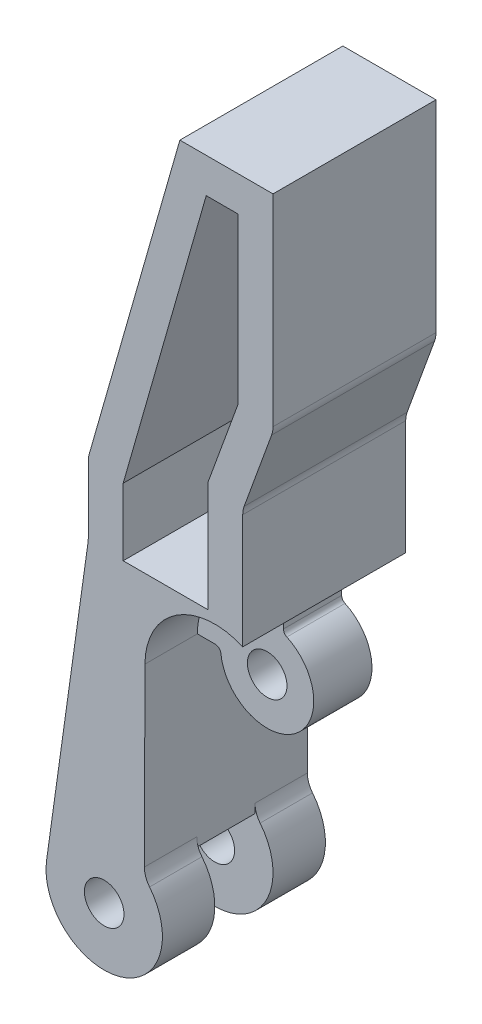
ISO-10303-21;
HEADER;
FILE_DESCRIPTION(('STEP AP214'),'2;1');
FILE_NAME('part.step','',(''),(''),'','','');
FILE_SCHEMA(('AUTOMOTIVE_DESIGN { 1 0 10303 214 1 1 1 1 }'));
ENDSEC;
DATA;
#1=APPLICATION_CONTEXT('core data for automotive mechanical design processes');
#2=APPLICATION_PROTOCOL_DEFINITION('international standard','automotive_design',2000,#1);
#3=PRODUCT_CONTEXT('',#1,'mechanical');
#4=PRODUCT('Part','Part','',(#3));
#5=PRODUCT_RELATED_PRODUCT_CATEGORY('part','',(#4));
#6=PRODUCT_DEFINITION_FORMATION('','',#4);
#7=PRODUCT_DEFINITION_CONTEXT('part definition',#1,'design');
#8=PRODUCT_DEFINITION('design','',#6,#7);
#9=PRODUCT_DEFINITION_SHAPE('','',#8);
#10=(LENGTH_UNIT() NAMED_UNIT(*) SI_UNIT(.MILLI.,.METRE.));
#11=(NAMED_UNIT(*) PLANE_ANGLE_UNIT() SI_UNIT($,.RADIAN.));
#12=(NAMED_UNIT(*) SI_UNIT($,.STERADIAN.) SOLID_ANGLE_UNIT());
#13=UNCERTAINTY_MEASURE_WITH_UNIT(LENGTH_MEASURE(1.E-05),#10,'distance_accuracy_value','');
#14=(GEOMETRIC_REPRESENTATION_CONTEXT(3) GLOBAL_UNCERTAINTY_ASSIGNED_CONTEXT((#13)) GLOBAL_UNIT_ASSIGNED_CONTEXT((#10,
#11,#12)) REPRESENTATION_CONTEXT('',''));
#15=CARTESIAN_POINT('',(0.,0.,0.));
#16=DIRECTION('',(0.,0.,1.));
#17=DIRECTION('',(1.,0.,0.));
#18=AXIS2_PLACEMENT_3D('',#15,#16,#17);
#19=CARTESIAN_POINT('',(0.,0.,-7.));
#20=DIRECTION('',(0.,0.,1.));
#21=DIRECTION('',(1.,0.,0.));
#22=AXIS2_PLACEMENT_3D('',#19,#20,#21);
#23=PLANE('',#22);
#24=DIRECTION('',(0.,-1.,0.));
#25=VECTOR('',#24,1.);
#26=CARTESIAN_POINT('',(-1.36999818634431,0.,-7.));
#27=LINE('',#26,#25);
#28=CARTESIAN_POINT('',(-1.36999818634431,32.1815612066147,-7.));
#29=VERTEX_POINT('',#28);
#30=CARTESIAN_POINT('',(-1.36999818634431,26.4100008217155,-7.));
#31=VERTEX_POINT('',#30);
#32=EDGE_CURVE('E429',#29,#31,#27,.T.);
#33=ORIENTED_EDGE('',*,*,#32,.F.);
#34=CARTESIAN_POINT('',(0.630001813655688,32.1815612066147,-7.));
#35=DIRECTION('',(0.,0.,1.));
#36=DIRECTION('',(1.,0.,0.));
#37=AXIS2_PLACEMENT_3D('',#34,#35,#36);
#38=CIRCLE('',#37,2.);
#39=CARTESIAN_POINT('',(-1.29301060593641,32.7311276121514,-7.));
#40=VERTEX_POINT('',#39);
#41=EDGE_CURVE('E475',#29,#40,#38,.F.);
#42=ORIENTED_EDGE('',*,*,#41,.T.);
#43=DIRECTION('',(-0.274783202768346,-0.961506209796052,0.));
#44=VECTOR('',#43,1.);
#45=CARTESIAN_POINT('',(-9.84313310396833,2.81301109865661,-7.));
#46=LINE('',#45,#44);
#47=CARTESIAN_POINT('',(6.49999999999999,60.,-7.));
#48=VERTEX_POINT('',#47);
#49=EDGE_CURVE('E426',#48,#40,#46,.T.);
#50=ORIENTED_EDGE('',*,*,#49,.F.);
#51=DIRECTION('',(1.,0.,0.));
#52=VECTOR('',#51,1.);
#53=CARTESIAN_POINT('',(0.,60.,-7.));
#54=LINE('',#53,#52);
#55=CARTESIAN_POINT('',(14.5,60.,-7.));
#56=VERTEX_POINT('',#55);
#57=EDGE_CURVE('E423',#48,#56,#54,.T.);
#58=ORIENTED_EDGE('',*,*,#57,.T.);
#59=DIRECTION('',(0.,-1.,0.));
#60=VECTOR('',#59,1.);
#61=CARTESIAN_POINT('',(14.5,0.,-7.));
#62=LINE('',#61,#60);
#63=CARTESIAN_POINT('',(14.5,42.6783400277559,-7.));
#64=VERTEX_POINT('',#63);
#65=EDGE_CURVE('E420',#56,#64,#62,.T.);
#66=ORIENTED_EDGE('',*,*,#65,.T.);
#67=CARTESIAN_POINT('',(12.5,42.6783400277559,-7.));
#68=DIRECTION('',(0.,0.,1.));
#69=DIRECTION('',(1.,0.,0.));
#70=AXIS2_PLACEMENT_3D('',#67,#68,#69);
#71=CIRCLE('',#70,2.);
#72=CARTESIAN_POINT('',(14.3792376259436,41.9938943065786,-7.));
#73=VERTEX_POINT('',#72);
#74=EDGE_CURVE('E473',#64,#73,#71,.F.);
#75=ORIENTED_EDGE('',*,*,#74,.T.);
#76=DIRECTION('',(-0.342222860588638,-0.939618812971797,0.));
#77=VECTOR('',#76,1.);
#78=CARTESIAN_POINT('',(-0.808324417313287,0.294403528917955,-7.));
#79=LINE('',#78,#77);
#80=CARTESIAN_POINT('',(12.0186781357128,35.5126612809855,-7.));
#81=VERTEX_POINT('',#80);
#82=EDGE_CURVE('E417',#73,#81,#79,.T.);
#83=ORIENTED_EDGE('',*,*,#82,.T.);
#84=CARTESIAN_POINT('',(13.8979157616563,34.8282155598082,-7.));
#85=DIRECTION('',(0.,0.,1.));
#86=DIRECTION('',(1.,0.,0.));
#87=AXIS2_PLACEMENT_3D('',#84,#85,#86);
#88=CIRCLE('',#87,2.);
#89=CARTESIAN_POINT('',(11.8979157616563,34.8282155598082,-7.));
#90=VERTEX_POINT('',#89);
#91=EDGE_CURVE('E43',#81,#90,#88,.T.);
#92=ORIENTED_EDGE('',*,*,#91,.T.);
#93=DIRECTION('',(0.,-1.,0.));
#94=VECTOR('',#93,1.);
#95=CARTESIAN_POINT('',(11.8979157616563,0.,-7.));
#96=LINE('',#95,#94);
#97=CARTESIAN_POINT('',(11.8979157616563,25.,-7.));
#98=VERTEX_POINT('',#97);
#99=EDGE_CURVE('E415',#90,#98,#96,.T.);
#100=ORIENTED_EDGE('',*,*,#99,.T.);
#101=CARTESIAN_POINT('',(9.5,19.5,-7.));
#102=DIRECTION('',(0.,0.,1.));
#103=DIRECTION('',(1.,0.,0.));
#104=AXIS2_PLACEMENT_3D('',#101,#102,#103);
#105=CIRCLE('',#104,6.);
#106=CARTESIAN_POINT('',(3.50003077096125,19.5192158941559,-7.));
#107=VERTEX_POINT('',#106);
#108=EDGE_CURVE('E384',#98,#107,#105,.T.);
#109=ORIENTED_EDGE('',*,*,#108,.T.);
#110=DIRECTION('',(0.00320264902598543,0.999994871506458,0.));
#111=VECTOR('',#110,1.);
#112=CARTESIAN_POINT('',(3.43748199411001,-0.0110091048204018,-7.));
#113=LINE('',#112,#111);
#114=CARTESIAN_POINT('',(3.45160040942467,4.39732374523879,-7.));
#115=VERTEX_POINT('',#114);
#116=EDGE_CURVE('E389',#115,#107,#113,.T.);
#117=ORIENTED_EDGE('',*,*,#116,.F.);
#118=CARTESIAN_POINT('',(5.45159015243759,4.39091844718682,-7.));
#119=DIRECTION('',(0.,0.,1.));
#120=DIRECTION('',(1.,0.,0.));
#121=AXIS2_PLACEMENT_3D('',#118,#119,#120);
#122=CIRCLE('',#121,2.);
#123=CARTESIAN_POINT('',(3.89399296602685,3.13637031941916,-7.));
#124=VERTEX_POINT('',#123);
#125=EDGE_CURVE('E492',#115,#124,#122,.T.);
#126=ORIENTED_EDGE('',*,*,#125,.T.);
#127=CARTESIAN_POINT('',(0.,0.,-7.));
#128=DIRECTION('',(0.,0.,1.));
#129=DIRECTION('',(1.,0.,0.));
#130=AXIS2_PLACEMENT_3D('',#127,#128,#129);
#131=CIRCLE('',#130,5.);
#132=CARTESIAN_POINT('',(-4.95168551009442,0.693405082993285,-7.));
#133=VERTEX_POINT('',#132);
#134=EDGE_CURVE('E434',#133,#124,#131,.T.);
#135=ORIENTED_EDGE('',*,*,#134,.F.);
#136=DIRECTION('',(-0.138681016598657,-0.990337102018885,0.));
#137=VECTOR('',#136,1.);
#138=CARTESIAN_POINT('',(-4.95168551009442,0.693405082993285,-7.));
#139=LINE('',#138,#137);
#140=CARTESIAN_POINT('',(-1.38932398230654,26.1326387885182,-7.));
#141=VERTEX_POINT('',#140);
#142=EDGE_CURVE('E432',#141,#133,#139,.T.);
#143=ORIENTED_EDGE('',*,*,#142,.F.);
#144=CARTESIAN_POINT('',(-3.36999818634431,26.4100008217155,-7.));
#145=DIRECTION('',(0.,0.,1.));
#146=DIRECTION('',(1.,0.,0.));
#147=AXIS2_PLACEMENT_3D('',#144,#145,#146);
#148=CIRCLE('',#147,2.);
#149=EDGE_CURVE('E500',#141,#31,#148,.T.);
#150=ORIENTED_EDGE('',*,*,#149,.T.);
#151=EDGE_LOOP('',(#33,#42,#50,#58,#66,#75,#83,#92,#100,#109,#117,#126,#135,#143,#150));
#152=FACE_BOUND('',#151,.T.);
#153=DIRECTION('',(1.,0.,0.));
#154=VECTOR('',#153,1.);
#155=CARTESIAN_POINT('',(1.63000181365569,26.2706465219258,-7.));
#156=LINE('',#155,#154);
#157=CARTESIAN_POINT('',(1.63000181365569,26.2706465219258,-7.));
#158=VERTEX_POINT('',#157);
#159=CARTESIAN_POINT('',(8.89791576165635,26.2706465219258,-7.));
#160=VERTEX_POINT('',#159);
#161=EDGE_CURVE('E342',#158,#160,#156,.T.);
#162=ORIENTED_EDGE('',*,*,#161,.T.);
#163=DIRECTION('',(0.,1.,0.));
#164=VECTOR('',#163,1.);
#165=CARTESIAN_POINT('',(8.89791576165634,35.7104065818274,-7.));
#166=LINE('',#165,#164);
#167=CARTESIAN_POINT('',(8.89791576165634,35.7104065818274,-7.));
#168=VERTEX_POINT('',#167);
#169=EDGE_CURVE('E324',#160,#168,#166,.T.);
#170=ORIENTED_EDGE('',*,*,#169,.T.);
#171=DIRECTION('',(0.342222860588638,0.939618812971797,0.));
#172=VECTOR('',#171,1.);
#173=CARTESIAN_POINT('',(11.5,42.8547782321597,-7.));
#174=LINE('',#173,#172);
#175=CARTESIAN_POINT('',(11.5,42.8547782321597,-7.));
#176=VERTEX_POINT('',#175);
#177=EDGE_CURVE('E327',#168,#176,#174,.T.);
#178=ORIENTED_EDGE('',*,*,#177,.T.);
#179=DIRECTION('',(0.,1.,0.));
#180=VECTOR('',#179,1.);
#181=CARTESIAN_POINT('',(11.5,57.,-7.));
#182=LINE('',#181,#180);
#183=CARTESIAN_POINT('',(11.5,57.,-7.));
#184=VERTEX_POINT('',#183);
#185=EDGE_CURVE('E330',#176,#184,#182,.T.);
#186=ORIENTED_EDGE('',*,*,#185,.T.);
#187=DIRECTION('',(-1.,0.,0.));
#188=VECTOR('',#187,1.);
#189=CARTESIAN_POINT('',(8.76275230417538,57.,-7.));
#190=LINE('',#189,#188);
#191=CARTESIAN_POINT('',(8.76275230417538,57.,-7.));
#192=VERTEX_POINT('',#191);
#193=EDGE_CURVE('E333',#184,#192,#190,.T.);
#194=ORIENTED_EDGE('',*,*,#193,.T.);
#195=DIRECTION('',(-0.274783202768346,-0.961506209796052,0.));
#196=VECTOR('',#195,1.);
#197=CARTESIAN_POINT('',(1.63000181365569,32.0414733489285,-7.));
#198=LINE('',#197,#196);
#199=CARTESIAN_POINT('',(1.63000181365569,32.0414733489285,-7.));
#200=VERTEX_POINT('',#199);
#201=EDGE_CURVE('E336',#192,#200,#198,.T.);
#202=ORIENTED_EDGE('',*,*,#201,.T.);
#203=DIRECTION('',(0.,-1.,0.));
#204=VECTOR('',#203,1.);
#205=CARTESIAN_POINT('',(1.63000181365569,26.2706465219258,-7.));
#206=LINE('',#205,#204);
#207=EDGE_CURVE('E339',#200,#158,#206,.T.);
#208=ORIENTED_EDGE('',*,*,#207,.T.);
#209=EDGE_LOOP('',(#162,#170,#178,#186,#194,#202,#208));
#210=FACE_BOUND('',#209,.T.);
#211=CARTESIAN_POINT('',(0.,0.,-7.));
#212=DIRECTION('',(0.,0.,-1.));
#213=DIRECTION('',(-1.,0.,0.));
#214=AXIS2_PLACEMENT_3D('',#211,#212,#213);
#215=CIRCLE('',#214,3.36);
#216=CARTESIAN_POINT('',(-3.36,0.,-7.));
#217=VERTEX_POINT('',#216);
#218=EDGE_CURVE('E671',#217,#217,#215,.T.);
#219=ORIENTED_EDGE('',*,*,#218,.F.);
#220=EDGE_LOOP('',(#219));
#221=FACE_BOUND('',#220,.T.);
#222=ADVANCED_FACE('F35',(#152,#210,#221),#23,.F.);
#223=CARTESIAN_POINT('',(0.,0.,7.));
#224=DIRECTION('',(0.,0.,-1.));
#225=DIRECTION('',(-1.,0.,0.));
#226=AXIS2_PLACEMENT_3D('',#223,#224,#225);
#227=CYLINDRICAL_SURFACE('',#226,5.);
#228=ORIENTED_EDGE('',*,*,#134,.T.);
#229=DIRECTION('',(0.,0.,-1.));
#230=VECTOR('',#229,1.);
#231=CARTESIAN_POINT('',(3.89399296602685,3.13637031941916,7.));
#232=LINE('',#231,#230);
#233=CARTESIAN_POINT('',(3.89399296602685,3.13637031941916,-2.5));
#234=VERTEX_POINT('',#233);
#235=EDGE_CURVE('E461',#124,#234,#232,.F.);
#236=ORIENTED_EDGE('',*,*,#235,.T.);
#237=CARTESIAN_POINT('',(0.,0.,-2.5));
#238=DIRECTION('',(0.,0.,1.));
#239=DIRECTION('',(1.,0.,0.));
#240=AXIS2_PLACEMENT_3D('',#237,#238,#239);
#241=CIRCLE('',#240,5.);
#242=CARTESIAN_POINT('',(-4.95168551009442,0.693405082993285,-2.5));
#243=VERTEX_POINT('',#242);
#244=EDGE_CURVE('E270',#243,#234,#241,.T.);
#245=ORIENTED_EDGE('',*,*,#244,.F.);
#246=DIRECTION('',(0.,0.,-1.));
#247=VECTOR('',#246,1.);
#248=CARTESIAN_POINT('',(-4.95168551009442,0.693405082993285,7.));
#249=LINE('',#248,#247);
#250=EDGE_CURVE('E264',#243,#133,#249,.T.);
#251=ORIENTED_EDGE('',*,*,#250,.T.);
#252=EDGE_LOOP('',(#228,#236,#245,#251));
#253=FACE_BOUND('',#252,.T.);
#254=ADVANCED_FACE('F565',(#253),#227,.T.);
#255=CARTESIAN_POINT('',(9.5,19.5,7.));
#256=DIRECTION('',(0.,0.,-1.));
#257=DIRECTION('',(-1.,0.,0.));
#258=AXIS2_PLACEMENT_3D('',#255,#256,#257);
#259=CYLINDRICAL_SURFACE('',#258,6.);
#260=CARTESIAN_POINT('',(9.5,19.5,2.5));
#261=DIRECTION('',(0.,0.,1.));
#262=DIRECTION('',(1.,0.,0.));
#263=AXIS2_PLACEMENT_3D('',#260,#261,#262);
#264=CIRCLE('',#263,6.);
#265=CARTESIAN_POINT('',(10.8979157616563,25.3348805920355,2.5));
#266=VERTEX_POINT('',#265);
#267=CARTESIAN_POINT('',(3.50003077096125,19.5192158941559,2.5));
#268=VERTEX_POINT('',#267);
#269=EDGE_CURVE('E280',#266,#268,#264,.T.);
#270=ORIENTED_EDGE('',*,*,#269,.F.);
#271=DIRECTION('',(0.,0.,-1.));
#272=VECTOR('',#271,1.);
#273=CARTESIAN_POINT('',(10.8979157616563,25.3348805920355,2.5));
#274=LINE('',#273,#272);
#275=CARTESIAN_POINT('',(10.8979157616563,25.3348805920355,-2.5));
#276=VERTEX_POINT('',#275);
#277=EDGE_CURVE('E295',#266,#276,#274,.T.);
#278=ORIENTED_EDGE('',*,*,#277,.T.);
#279=CARTESIAN_POINT('',(9.5,19.5,-2.5));
#280=DIRECTION('',(0.,0.,1.));
#281=DIRECTION('',(1.,0.,0.));
#282=AXIS2_PLACEMENT_3D('',#279,#280,#281);
#283=CIRCLE('',#282,6.);
#284=CARTESIAN_POINT('',(3.50003077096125,19.5192158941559,-2.5));
#285=VERTEX_POINT('',#284);
#286=EDGE_CURVE('E279',#276,#285,#283,.T.);
#287=ORIENTED_EDGE('',*,*,#286,.T.);
#288=DIRECTION('',(0.,0.,-1.));
#289=VECTOR('',#288,1.);
#290=CARTESIAN_POINT('',(3.50003077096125,19.5192158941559,7.));
#291=LINE('',#290,#289);
#292=EDGE_CURVE('E412',#285,#107,#291,.T.);
#293=ORIENTED_EDGE('',*,*,#292,.T.);
#294=ORIENTED_EDGE('',*,*,#108,.F.);
#295=DIRECTION('',(0.,0.,-1.));
#296=VECTOR('',#295,1.);
#297=CARTESIAN_POINT('',(11.8979157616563,25.,7.));
#298=LINE('',#297,#296);
#299=CARTESIAN_POINT('',(11.8979157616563,25.,7.));
#300=VERTEX_POINT('',#299);
#301=EDGE_CURVE('E256',#300,#98,#298,.T.);
#302=ORIENTED_EDGE('',*,*,#301,.F.);
#303=CARTESIAN_POINT('',(9.5,19.5,7.));
#304=DIRECTION('',(0.,0.,1.));
#305=DIRECTION('',(1.,0.,0.));
#306=AXIS2_PLACEMENT_3D('',#303,#304,#305);
#307=CIRCLE('',#306,6.);
#308=CARTESIAN_POINT('',(3.50003077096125,19.5192158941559,7.));
#309=VERTEX_POINT('',#308);
#310=EDGE_CURVE('E385',#300,#309,#307,.T.);
#311=ORIENTED_EDGE('',*,*,#310,.T.);
#312=EDGE_CURVE('E265',#309,#268,#291,.T.);
#313=ORIENTED_EDGE('',*,*,#312,.T.);
#314=EDGE_LOOP('',(#270,#278,#287,#293,#294,#302,#311,#313));
#315=FACE_BOUND('',#314,.T.);
#316=ADVANCED_FACE('F573',(#315),#259,.F.);
#317=CARTESIAN_POINT('',(11.8979157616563,0.,7.));
#318=DIRECTION('',(1.,0.,0.));
#319=DIRECTION('',(0.,0.,-1.));
#320=AXIS2_PLACEMENT_3D('',#317,#318,#319);
#321=PLANE('',#320);
#322=ORIENTED_EDGE('',*,*,#99,.F.);
#323=DIRECTION('',(0.,0.,-1.));
#324=VECTOR('',#323,1.);
#325=CARTESIAN_POINT('',(11.8979157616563,34.8282155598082,7.));
#326=LINE('',#325,#324);
#327=CARTESIAN_POINT('',(11.8979157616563,34.8282155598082,7.));
#328=VERTEX_POINT('',#327);
#329=EDGE_CURVE('E490',#90,#328,#326,.F.);
#330=ORIENTED_EDGE('',*,*,#329,.T.);
#331=DIRECTION('',(0.,-1.,0.));
#332=VECTOR('',#331,1.);
#333=CARTESIAN_POINT('',(11.8979157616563,0.,7.));
#334=LINE('',#333,#332);
#335=EDGE_CURVE('E388',#328,#300,#334,.T.);
#336=ORIENTED_EDGE('',*,*,#335,.T.);
#337=ORIENTED_EDGE('',*,*,#301,.T.);
#338=EDGE_LOOP('',(#322,#330,#336,#337));
#339=FACE_BOUND('',#338,.T.);
#340=ADVANCED_FACE('F512',(#339),#321,.T.);
#341=CARTESIAN_POINT('',(-0.808324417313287,0.294403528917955,7.));
#342=DIRECTION('',(0.939618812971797,-0.342222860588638,0.));
#343=DIRECTION('',(0.342222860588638,0.939618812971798,0.));
#344=AXIS2_PLACEMENT_3D('',#341,#342,#343);
#345=PLANE('',#344);
#346=ORIENTED_EDGE('',*,*,#82,.F.);
#347=DIRECTION('',(0.,0.,-1.));
#348=VECTOR('',#347,1.);
#349=CARTESIAN_POINT('',(14.3792376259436,41.9938943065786,7.));
#350=LINE('',#349,#348);
#351=CARTESIAN_POINT('',(14.3792376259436,41.9938943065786,7.));
#352=VERTEX_POINT('',#351);
#353=EDGE_CURVE('E488',#73,#352,#350,.F.);
#354=ORIENTED_EDGE('',*,*,#353,.T.);
#355=DIRECTION('',(-0.342222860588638,-0.939618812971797,0.));
#356=VECTOR('',#355,1.);
#357=CARTESIAN_POINT('',(-0.808324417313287,0.294403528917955,7.));
#358=LINE('',#357,#356);
#359=CARTESIAN_POINT('',(12.0186781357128,35.5126612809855,7.));
#360=VERTEX_POINT('',#359);
#361=EDGE_CURVE('E391',#352,#360,#358,.T.);
#362=ORIENTED_EDGE('',*,*,#361,.T.);
#363=DIRECTION('',(0.,0.,-1.));
#364=VECTOR('',#363,1.);
#365=CARTESIAN_POINT('',(12.0186781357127,35.5126612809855,-7.));
#366=LINE('',#365,#364);
#367=EDGE_CURVE('E485',#360,#81,#366,.T.);
#368=ORIENTED_EDGE('',*,*,#367,.T.);
#369=EDGE_LOOP('',(#346,#354,#362,#368));
#370=FACE_BOUND('',#369,.T.);
#371=ADVANCED_FACE('F520',(#370),#345,.T.);
#372=CARTESIAN_POINT('',(14.5,0.,7.));
#373=DIRECTION('',(1.,0.,0.));
#374=DIRECTION('',(0.,1.,0.));
#375=AXIS2_PLACEMENT_3D('',#372,#373,#374);
#376=PLANE('',#375);
#377=DIRECTION('',(0.,-1.,0.));
#378=VECTOR('',#377,1.);
#379=CARTESIAN_POINT('',(14.5,0.,7.));
#380=LINE('',#379,#378);
#381=CARTESIAN_POINT('',(14.5,60.,7.));
#382=VERTEX_POINT('',#381);
#383=CARTESIAN_POINT('',(14.5,42.6783400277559,7.));
#384=VERTEX_POINT('',#383);
#385=EDGE_CURVE('E394',#382,#384,#380,.T.);
#386=ORIENTED_EDGE('',*,*,#385,.T.);
#387=DIRECTION('',(0.,0.,-1.));
#388=VECTOR('',#387,1.);
#389=CARTESIAN_POINT('',(14.5,42.6783400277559,7.));
#390=LINE('',#389,#388);
#391=EDGE_CURVE('E482',#384,#64,#390,.T.);
#392=ORIENTED_EDGE('',*,*,#391,.T.);
#393=ORIENTED_EDGE('',*,*,#65,.F.);
#394=DIRECTION('',(0.,0.,-1.));
#395=VECTOR('',#394,1.);
#396=CARTESIAN_POINT('',(14.5,60.,7.));
#397=LINE('',#396,#395);
#398=EDGE_CURVE('E445',#382,#56,#397,.T.);
#399=ORIENTED_EDGE('',*,*,#398,.F.);
#400=EDGE_LOOP('',(#386,#392,#393,#399));
#401=FACE_BOUND('',#400,.T.);
#402=ADVANCED_FACE('F527',(#401),#376,.T.);
#403=CARTESIAN_POINT('',(0.,60.,7.));
#404=DIRECTION('',(0.,1.,0.));
#405=DIRECTION('',(-1.,0.,0.));
#406=AXIS2_PLACEMENT_3D('',#403,#404,#405);
#407=PLANE('',#406);
#408=ORIENTED_EDGE('',*,*,#57,.F.);
#409=DIRECTION('',(0.,0.,-1.));
#410=VECTOR('',#409,1.);
#411=CARTESIAN_POINT('',(6.49999999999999,60.,7.));
#412=LINE('',#411,#410);
#413=CARTESIAN_POINT('',(6.49999999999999,60.,7.));
#414=VERTEX_POINT('',#413);
#415=EDGE_CURVE('E443',#414,#48,#412,.T.);
#416=ORIENTED_EDGE('',*,*,#415,.F.);
#417=DIRECTION('',(1.,0.,0.));
#418=VECTOR('',#417,1.);
#419=CARTESIAN_POINT('',(0.,60.,7.));
#420=LINE('',#419,#418);
#421=EDGE_CURVE('E396',#414,#382,#420,.T.);
#422=ORIENTED_EDGE('',*,*,#421,.T.);
#423=ORIENTED_EDGE('',*,*,#398,.T.);
#424=EDGE_LOOP('',(#408,#416,#422,#423));
#425=FACE_BOUND('',#424,.T.);
#426=ADVANCED_FACE('F531',(#425),#407,.T.);
#427=CARTESIAN_POINT('',(-9.84313310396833,2.81301109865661,7.));
#428=DIRECTION('',(0.961506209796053,-0.274783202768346,0.));
#429=DIRECTION('',(0.274783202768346,0.961506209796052,0.));
#430=AXIS2_PLACEMENT_3D('',#427,#428,#429);
#431=PLANE('',#430);
#432=ORIENTED_EDGE('',*,*,#49,.T.);
#433=DIRECTION('',(0.,0.,-1.));
#434=VECTOR('',#433,1.);
#435=CARTESIAN_POINT('',(-1.29301060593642,32.7311276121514,7.));
#436=LINE('',#435,#434);
#437=CARTESIAN_POINT('',(-1.29301060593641,32.7311276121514,7.));
#438=VERTEX_POINT('',#437);
#439=EDGE_CURVE('E477',#40,#438,#436,.F.);
#440=ORIENTED_EDGE('',*,*,#439,.T.);
#441=DIRECTION('',(-0.274783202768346,-0.961506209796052,0.));
#442=VECTOR('',#441,1.);
#443=CARTESIAN_POINT('',(-9.84313310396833,2.81301109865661,7.));
#444=LINE('',#443,#442);
#445=EDGE_CURVE('E399',#414,#438,#444,.T.);
#446=ORIENTED_EDGE('',*,*,#445,.F.);
#447=ORIENTED_EDGE('',*,*,#415,.T.);
#448=EDGE_LOOP('',(#432,#440,#446,#447));
#449=FACE_BOUND('',#448,.T.);
#450=ADVANCED_FACE('F800',(#449),#431,.F.);
#451=CARTESIAN_POINT('',(-1.36999818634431,0.,7.));
#452=DIRECTION('',(1.,0.,0.));
#453=DIRECTION('',(0.,0.,-1.));
#454=AXIS2_PLACEMENT_3D('',#451,#452,#453);
#455=PLANE('',#454);
#456=ORIENTED_EDGE('',*,*,#32,.T.);
#457=DIRECTION('',(0.,0.,-1.));
#458=VECTOR('',#457,1.);
#459=CARTESIAN_POINT('',(-1.36999818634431,26.4100008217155,7.));
#460=LINE('',#459,#458);
#461=CARTESIAN_POINT('',(-1.36999818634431,26.4100008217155,7.));
#462=VERTEX_POINT('',#461);
#463=EDGE_CURVE('E471',#31,#462,#460,.F.);
#464=ORIENTED_EDGE('',*,*,#463,.T.);
#465=DIRECTION('',(0.,-1.,0.));
#466=VECTOR('',#465,1.);
#467=CARTESIAN_POINT('',(-1.36999818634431,0.,7.));
#468=LINE('',#467,#466);
#469=CARTESIAN_POINT('',(-1.36999818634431,32.1815612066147,7.));
#470=VERTEX_POINT('',#469);
#471=EDGE_CURVE('E402',#470,#462,#468,.T.);
#472=ORIENTED_EDGE('',*,*,#471,.F.);
#473=DIRECTION('',(0.,0.,-1.));
#474=VECTOR('',#473,1.);
#475=CARTESIAN_POINT('',(-1.36999818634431,32.1815612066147,7.));
#476=LINE('',#475,#474);
#477=EDGE_CURVE('E468',#470,#29,#476,.T.);
#478=ORIENTED_EDGE('',*,*,#477,.T.);
#479=EDGE_LOOP('',(#456,#464,#472,#478));
#480=FACE_BOUND('',#479,.T.);
#481=ADVANCED_FACE('F542',(#480),#455,.F.);
#482=CARTESIAN_POINT('',(-4.95168551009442,0.693405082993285,7.));
#483=DIRECTION('',(0.990337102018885,-0.138681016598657,0.));
#484=DIRECTION('',(0.138681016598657,0.990337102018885,0.));
#485=AXIS2_PLACEMENT_3D('',#482,#483,#484);
#486=PLANE('',#485);
#487=DIRECTION('',(-0.138681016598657,-0.990337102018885,0.));
#488=VECTOR('',#487,1.);
#489=CARTESIAN_POINT('',(-4.95168551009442,0.693405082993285,7.));
#490=LINE('',#489,#488);
#491=CARTESIAN_POINT('',(-1.38932398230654,26.1326387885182,7.));
#492=VERTEX_POINT('',#491);
#493=CARTESIAN_POINT('',(-4.95168551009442,0.693405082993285,7.));
#494=VERTEX_POINT('',#493);
#495=EDGE_CURVE('E405',#492,#494,#490,.T.);
#496=ORIENTED_EDGE('',*,*,#495,.F.);
#497=DIRECTION('',(0.,0.,-1.));
#498=VECTOR('',#497,1.);
#499=CARTESIAN_POINT('',(-1.38932398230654,26.1326387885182,-7.));
#500=LINE('',#499,#498);
#501=EDGE_CURVE('E465',#492,#141,#500,.T.);
#502=ORIENTED_EDGE('',*,*,#501,.T.);
#503=ORIENTED_EDGE('',*,*,#142,.T.);
#504=ORIENTED_EDGE('',*,*,#250,.F.);
#505=DIRECTION('',(0.,0.,1.));
#506=VECTOR('',#505,1.);
#507=CARTESIAN_POINT('',(-4.95168551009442,0.693405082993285,-2.5));
#508=LINE('',#507,#506);
#509=CARTESIAN_POINT('',(-4.95168551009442,0.693405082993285,2.5));
#510=VERTEX_POINT('',#509);
#511=EDGE_CURVE('E277',#243,#510,#508,.T.);
#512=ORIENTED_EDGE('',*,*,#511,.T.);
#513=EDGE_CURVE('E440',#494,#510,#249,.T.);
#514=ORIENTED_EDGE('',*,*,#513,.F.);
#515=EDGE_LOOP('',(#496,#502,#503,#504,#512,#514));
#516=FACE_BOUND('',#515,.T.);
#517=ADVANCED_FACE('F552',(#516),#486,.F.);
#518=CARTESIAN_POINT('',(0.,0.,2.5));
#519=DIRECTION('',(0.,0.,1.));
#520=DIRECTION('',(1.,0.,0.));
#521=AXIS2_PLACEMENT_3D('',#518,#519,#520);
#522=CIRCLE('',#521,5.);
#523=CARTESIAN_POINT('',(3.89399296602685,3.13637031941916,2.5));
#524=VERTEX_POINT('',#523);
#525=EDGE_CURVE('E269',#510,#524,#522,.T.);
#526=ORIENTED_EDGE('',*,*,#525,.T.);
#527=DIRECTION('',(0.,0.,-1.));
#528=VECTOR('',#527,1.);
#529=CARTESIAN_POINT('',(3.89399296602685,3.13637031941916,7.));
#530=LINE('',#529,#528);
#531=CARTESIAN_POINT('',(3.89399296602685,3.13637031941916,7.));
#532=VERTEX_POINT('',#531);
#533=EDGE_CURVE('E463',#524,#532,#530,.F.);
#534=ORIENTED_EDGE('',*,*,#533,.T.);
#535=CARTESIAN_POINT('',(0.,0.,7.));
#536=DIRECTION('',(0.,0.,1.));
#537=DIRECTION('',(1.,0.,0.));
#538=AXIS2_PLACEMENT_3D('',#535,#536,#537);
#539=CIRCLE('',#538,5.);
#540=EDGE_CURVE('E407',#494,#532,#539,.T.);
#541=ORIENTED_EDGE('',*,*,#540,.F.);
#542=ORIENTED_EDGE('',*,*,#513,.T.);
#543=EDGE_LOOP('',(#526,#534,#541,#542));
#544=FACE_BOUND('',#543,.T.);
#545=ADVANCED_FACE('F562',(#544),#227,.T.);
#546=CARTESIAN_POINT('',(3.43748199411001,-0.0110091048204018,7.));
#547=DIRECTION('',(-0.999994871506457,0.00320264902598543,0.));
#548=DIRECTION('',(-0.00320264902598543,-0.999994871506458,0.));
#549=AXIS2_PLACEMENT_3D('',#546,#547,#548);
#550=PLANE('',#549);
#551=DIRECTION('',(0.00320264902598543,0.999994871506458,0.));
#552=VECTOR('',#551,1.);
#553=CARTESIAN_POINT('',(3.43748199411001,-0.0110091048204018,-2.5));
#554=LINE('',#553,#552);
#555=CARTESIAN_POINT('',(3.44911056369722,3.61989451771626,-2.5));
#556=VERTEX_POINT('',#555);
#557=CARTESIAN_POINT('',(3.45160040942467,4.39732374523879,-2.5));
#558=VERTEX_POINT('',#557);
#559=EDGE_CURVE('E50',#556,#558,#554,.T.);
#560=ORIENTED_EDGE('',*,*,#559,.T.);
#561=DIRECTION('',(0.,0.,1.));
#562=VECTOR('',#561,1.);
#563=CARTESIAN_POINT('',(3.45160040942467,4.39732374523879,-7.));
#564=LINE('',#563,#562);
#565=EDGE_CURVE('E458',#558,#115,#564,.F.);
#566=ORIENTED_EDGE('',*,*,#565,.T.);
#567=ORIENTED_EDGE('',*,*,#116,.T.);
#568=ORIENTED_EDGE('',*,*,#292,.F.);
#569=DIRECTION('',(0.,0.,-1.));
#570=VECTOR('',#569,1.);
#571=CARTESIAN_POINT('',(3.50003077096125,19.5192158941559,2.5));
#572=LINE('',#571,#570);
#573=EDGE_CURVE('E321',#268,#285,#572,.T.);
#574=ORIENTED_EDGE('',*,*,#573,.F.);
#575=ORIENTED_EDGE('',*,*,#312,.F.);
#576=DIRECTION('',(0.00320264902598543,0.999994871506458,0.));
#577=VECTOR('',#576,1.);
#578=CARTESIAN_POINT('',(3.43748199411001,-0.0110091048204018,7.));
#579=LINE('',#578,#577);
#580=CARTESIAN_POINT('',(3.45160040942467,4.39732374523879,7.));
#581=VERTEX_POINT('',#580);
#582=EDGE_CURVE('E410',#581,#309,#579,.T.);
#583=ORIENTED_EDGE('',*,*,#582,.F.);
#584=DIRECTION('',(0.,0.,1.));
#585=VECTOR('',#584,1.);
#586=CARTESIAN_POINT('',(3.45160040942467,4.39732374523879,2.5));
#587=LINE('',#586,#585);
#588=CARTESIAN_POINT('',(3.45160040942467,4.39732374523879,2.5));
#589=VERTEX_POINT('',#588);
#590=EDGE_CURVE('E253',#581,#589,#587,.F.);
#591=ORIENTED_EDGE('',*,*,#590,.T.);
#592=DIRECTION('',(-0.00320264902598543,-0.999994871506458,0.));
#593=VECTOR('',#592,1.);
#594=CARTESIAN_POINT('',(3.43748199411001,-0.0110091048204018,2.5));
#595=LINE('',#594,#593);
#596=CARTESIAN_POINT('',(3.44911056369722,3.61989451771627,2.5));
#597=VERTEX_POINT('',#596);
#598=EDGE_CURVE('E246',#589,#597,#595,.T.);
#599=ORIENTED_EDGE('',*,*,#598,.T.);
#600=DIRECTION('',(0.,0.,-1.));
#601=VECTOR('',#600,1.);
#602=CARTESIAN_POINT('',(3.44911056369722,3.61989451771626,7.));
#603=LINE('',#602,#601);
#604=EDGE_CURVE('E249',#597,#556,#603,.T.);
#605=ORIENTED_EDGE('',*,*,#604,.T.);
#606=EDGE_LOOP('',(#560,#566,#567,#568,#574,#575,#583,#591,#599,#605));
#607=FACE_BOUND('',#606,.T.);
#608=ADVANCED_FACE('F248',(#607),#550,.F.);
#609=CARTESIAN_POINT('',(0.,0.,7.));
#610=DIRECTION('',(0.,0.,1.));
#611=DIRECTION('',(1.,0.,0.));
#612=AXIS2_PLACEMENT_3D('',#609,#610,#611);
#613=PLANE('',#612);
#614=CARTESIAN_POINT('',(0.,0.,7.));
#615=DIRECTION('',(0.,0.,1.));
#616=DIRECTION('',(1.,0.,0.));
#617=AXIS2_PLACEMENT_3D('',#614,#615,#616);
#618=CIRCLE('',#617,1.69999999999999);
#619=CARTESIAN_POINT('',(1.69999999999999,0.,7.));
#620=VERTEX_POINT('',#619);
#621=EDGE_CURVE('E678',#620,#620,#618,.T.);
#622=ORIENTED_EDGE('',*,*,#621,.F.);
#623=EDGE_LOOP('',(#622));
#624=FACE_BOUND('',#623,.T.);
#625=DIRECTION('',(0.,1.,0.));
#626=VECTOR('',#625,1.);
#627=CARTESIAN_POINT('',(8.89791576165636,0.,7.));
#628=LINE('',#627,#626);
#629=CARTESIAN_POINT('',(8.89791576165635,26.2706465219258,7.));
#630=VERTEX_POINT('',#629);
#631=CARTESIAN_POINT('',(8.89791576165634,35.7104065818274,7.));
#632=VERTEX_POINT('',#631);
#633=EDGE_CURVE('E381',#630,#632,#628,.T.);
#634=ORIENTED_EDGE('',*,*,#633,.F.);
#635=DIRECTION('',(1.,0.,0.));
#636=VECTOR('',#635,1.);
#637=CARTESIAN_POINT('',(0.,26.2706465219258,7.));
#638=LINE('',#637,#636);
#639=CARTESIAN_POINT('',(1.63000181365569,26.2706465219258,7.));
#640=VERTEX_POINT('',#639);
#641=EDGE_CURVE('E377',#640,#630,#638,.T.);
#642=ORIENTED_EDGE('',*,*,#641,.F.);
#643=DIRECTION('',(0.,-1.,0.));
#644=VECTOR('',#643,1.);
#645=CARTESIAN_POINT('',(1.63000181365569,0.,7.));
#646=LINE('',#645,#644);
#647=CARTESIAN_POINT('',(1.63000181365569,32.0414733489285,7.));
#648=VERTEX_POINT('',#647);
#649=EDGE_CURVE('E373',#648,#640,#646,.T.);
#650=ORIENTED_EDGE('',*,*,#649,.F.);
#651=DIRECTION('',(-0.274783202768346,-0.961506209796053,0.));
#652=VECTOR('',#651,1.);
#653=CARTESIAN_POINT('',(-6.95861447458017,1.98866149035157,7.));
#654=LINE('',#653,#652);
#655=CARTESIAN_POINT('',(8.76275230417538,57.,7.));
#656=VERTEX_POINT('',#655);
#657=EDGE_CURVE('E371',#656,#648,#654,.T.);
#658=ORIENTED_EDGE('',*,*,#657,.F.);
#659=DIRECTION('',(-1.,0.,0.));
#660=VECTOR('',#659,1.);
#661=CARTESIAN_POINT('',(-1.44494396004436E-13,57.,7.));
#662=LINE('',#661,#660);
#663=CARTESIAN_POINT('',(11.5,57.,7.));
#664=VERTEX_POINT('',#663);
#665=EDGE_CURVE('E369',#664,#656,#662,.T.);
#666=ORIENTED_EDGE('',*,*,#665,.F.);
#667=DIRECTION('',(0.,1.,0.));
#668=VECTOR('',#667,1.);
#669=CARTESIAN_POINT('',(11.5,0.,7.));
#670=LINE('',#669,#668);
#671=CARTESIAN_POINT('',(11.5,42.8547782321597,7.));
#672=VERTEX_POINT('',#671);
#673=EDGE_CURVE('E367',#672,#664,#670,.T.);
#674=ORIENTED_EDGE('',*,*,#673,.F.);
#675=DIRECTION('',(0.342222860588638,0.939618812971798,0.));
#676=VECTOR('',#675,1.);
#677=CARTESIAN_POINT('',(11.5,42.8547782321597,7.));
#678=LINE('',#677,#676);
#679=EDGE_CURVE('E349',#632,#672,#678,.T.);
#680=ORIENTED_EDGE('',*,*,#679,.F.);
#681=EDGE_LOOP('',(#634,#642,#650,#658,#666,#674,#680));
#682=FACE_BOUND('',#681,.T.);
#683=ORIENTED_EDGE('',*,*,#445,.T.);
#684=CARTESIAN_POINT('',(0.630001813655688,32.1815612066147,7.));
#685=DIRECTION('',(0.,0.,1.));
#686=DIRECTION('',(1.,0.,0.));
#687=AXIS2_PLACEMENT_3D('',#684,#685,#686);
#688=CIRCLE('',#687,2.);
#689=EDGE_CURVE('E480',#438,#470,#688,.T.);
#690=ORIENTED_EDGE('',*,*,#689,.T.);
#691=ORIENTED_EDGE('',*,*,#471,.T.);
#692=CARTESIAN_POINT('',(-3.36999818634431,26.4100008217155,7.));
#693=DIRECTION('',(0.,0.,1.));
#694=DIRECTION('',(1.,0.,0.));
#695=AXIS2_PLACEMENT_3D('',#692,#693,#694);
#696=CIRCLE('',#695,2.);
#697=EDGE_CURVE('E502',#462,#492,#696,.F.);
#698=ORIENTED_EDGE('',*,*,#697,.T.);
#699=ORIENTED_EDGE('',*,*,#495,.T.);
#700=ORIENTED_EDGE('',*,*,#540,.T.);
#701=CARTESIAN_POINT('',(5.45159015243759,4.39091844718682,7.));
#702=DIRECTION('',(0.,0.,1.));
#703=DIRECTION('',(1.,0.,0.));
#704=AXIS2_PLACEMENT_3D('',#701,#702,#703);
#705=CIRCLE('',#704,2.);
#706=EDGE_CURVE('E498',#532,#581,#705,.F.);
#707=ORIENTED_EDGE('',*,*,#706,.T.);
#708=ORIENTED_EDGE('',*,*,#582,.T.);
#709=ORIENTED_EDGE('',*,*,#310,.F.);
#710=ORIENTED_EDGE('',*,*,#335,.F.);
#711=CARTESIAN_POINT('',(13.8979157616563,34.8282155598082,7.));
#712=DIRECTION('',(0.,0.,1.));
#713=DIRECTION('',(1.,0.,0.));
#714=AXIS2_PLACEMENT_3D('',#711,#712,#713);
#715=CIRCLE('',#714,2.);
#716=EDGE_CURVE('E11',#328,#360,#715,.F.);
#717=ORIENTED_EDGE('',*,*,#716,.T.);
#718=ORIENTED_EDGE('',*,*,#361,.F.);
#719=CARTESIAN_POINT('',(12.5,42.6783400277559,7.));
#720=DIRECTION('',(0.,0.,1.));
#721=DIRECTION('',(1.,0.,0.));
#722=AXIS2_PLACEMENT_3D('',#719,#720,#721);
#723=CIRCLE('',#722,2.);
#724=EDGE_CURVE('E58',#352,#384,#723,.T.);
#725=ORIENTED_EDGE('',*,*,#724,.T.);
#726=ORIENTED_EDGE('',*,*,#385,.F.);
#727=ORIENTED_EDGE('',*,*,#421,.F.);
#728=EDGE_LOOP('',(#683,#690,#691,#698,#699,#700,#707,#708,#709,#710,#717,#718,#725,#726,#727));
#729=FACE_BOUND('',#728,.T.);
#730=ADVANCED_FACE('F517',(#624,#682,#729),#613,.T.);
#731=CARTESIAN_POINT('',(8.89791576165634,35.7104065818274,-7.));
#732=DIRECTION('',(1.,0.,0.));
#733=DIRECTION('',(0.,1.,0.));
#734=AXIS2_PLACEMENT_3D('',#731,#732,#733);
#735=PLANE('',#734);
#736=ORIENTED_EDGE('',*,*,#633,.T.);
#737=DIRECTION('',(0.,0.,1.));
#738=VECTOR('',#737,1.);
#739=CARTESIAN_POINT('',(8.89791576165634,35.7104065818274,-7.));
#740=LINE('',#739,#738);
#741=EDGE_CURVE('E345',#168,#632,#740,.T.);
#742=ORIENTED_EDGE('',*,*,#741,.F.);
#743=ORIENTED_EDGE('',*,*,#169,.F.);
#744=DIRECTION('',(0.,0.,1.));
#745=VECTOR('',#744,1.);
#746=CARTESIAN_POINT('',(8.89791576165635,26.2706465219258,-7.));
#747=LINE('',#746,#745);
#748=EDGE_CURVE('E346',#160,#630,#747,.T.);
#749=ORIENTED_EDGE('',*,*,#748,.T.);
#750=EDGE_LOOP('',(#736,#742,#743,#749));
#751=FACE_BOUND('',#750,.T.);
#752=ADVANCED_FACE('F583',(#751),#735,.F.);
#753=CARTESIAN_POINT('',(1.63000181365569,26.2706465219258,-7.));
#754=DIRECTION('',(0.,-1.,0.));
#755=DIRECTION('',(0.,0.,-1.));
#756=AXIS2_PLACEMENT_3D('',#753,#754,#755);
#757=PLANE('',#756);
#758=ORIENTED_EDGE('',*,*,#641,.T.);
#759=ORIENTED_EDGE('',*,*,#748,.F.);
#760=ORIENTED_EDGE('',*,*,#161,.F.);
#761=DIRECTION('',(0.,0.,1.));
#762=VECTOR('',#761,1.);
#763=CARTESIAN_POINT('',(1.63000181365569,26.2706465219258,-7.));
#764=LINE('',#763,#762);
#765=EDGE_CURVE('E350',#158,#640,#764,.T.);
#766=ORIENTED_EDGE('',*,*,#765,.T.);
#767=EDGE_LOOP('',(#758,#759,#760,#766));
#768=FACE_BOUND('',#767,.T.);
#769=ADVANCED_FACE('F587',(#768),#757,.F.);
#770=CARTESIAN_POINT('',(1.63000181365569,26.2706465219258,-7.));
#771=DIRECTION('',(-1.,0.,0.));
#772=DIRECTION('',(0.,-1.,0.));
#773=AXIS2_PLACEMENT_3D('',#770,#771,#772);
#774=PLANE('',#773);
#775=ORIENTED_EDGE('',*,*,#649,.T.);
#776=ORIENTED_EDGE('',*,*,#765,.F.);
#777=ORIENTED_EDGE('',*,*,#207,.F.);
#778=DIRECTION('',(0.,0.,1.));
#779=VECTOR('',#778,1.);
#780=CARTESIAN_POINT('',(1.63000181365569,32.0414733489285,-7.));
#781=LINE('',#780,#779);
#782=EDGE_CURVE('E353',#200,#648,#781,.T.);
#783=ORIENTED_EDGE('',*,*,#782,.T.);
#784=EDGE_LOOP('',(#775,#776,#777,#783));
#785=FACE_BOUND('',#784,.T.);
#786=ADVANCED_FACE('F605',(#785),#774,.F.);
#787=CARTESIAN_POINT('',(1.63000181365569,32.0414733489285,-7.));
#788=DIRECTION('',(-0.961506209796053,0.274783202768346,0.));
#789=DIRECTION('',(-0.274783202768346,-0.961506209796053,0.));
#790=AXIS2_PLACEMENT_3D('',#787,#788,#789);
#791=PLANE('',#790);
#792=ORIENTED_EDGE('',*,*,#657,.T.);
#793=ORIENTED_EDGE('',*,*,#782,.F.);
#794=ORIENTED_EDGE('',*,*,#201,.F.);
#795=DIRECTION('',(0.,0.,1.));
#796=VECTOR('',#795,1.);
#797=CARTESIAN_POINT('',(8.76275230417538,57.,-7.));
#798=LINE('',#797,#796);
#799=EDGE_CURVE('E354',#192,#656,#798,.T.);
#800=ORIENTED_EDGE('',*,*,#799,.T.);
#801=EDGE_LOOP('',(#792,#793,#794,#800));
#802=FACE_BOUND('',#801,.T.);
#803=ADVANCED_FACE('F601',(#802),#791,.F.);
#804=CARTESIAN_POINT('',(8.76275230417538,57.,-7.));
#805=DIRECTION('',(0.,1.,0.));
#806=DIRECTION('',(-1.,0.,0.));
#807=AXIS2_PLACEMENT_3D('',#804,#805,#806);
#808=PLANE('',#807);
#809=ORIENTED_EDGE('',*,*,#665,.T.);
#810=ORIENTED_EDGE('',*,*,#799,.F.);
#811=ORIENTED_EDGE('',*,*,#193,.F.);
#812=DIRECTION('',(0.,0.,1.));
#813=VECTOR('',#812,1.);
#814=CARTESIAN_POINT('',(11.5,57.,-7.));
#815=LINE('',#814,#813);
#816=EDGE_CURVE('E357',#184,#664,#815,.T.);
#817=ORIENTED_EDGE('',*,*,#816,.T.);
#818=EDGE_LOOP('',(#809,#810,#811,#817));
#819=FACE_BOUND('',#818,.T.);
#820=ADVANCED_FACE('F597',(#819),#808,.F.);
#821=CARTESIAN_POINT('',(11.5,57.,-7.));
#822=DIRECTION('',(1.,0.,0.));
#823=DIRECTION('',(0.,1.,0.));
#824=AXIS2_PLACEMENT_3D('',#821,#822,#823);
#825=PLANE('',#824);
#826=ORIENTED_EDGE('',*,*,#673,.T.);
#827=ORIENTED_EDGE('',*,*,#816,.F.);
#828=ORIENTED_EDGE('',*,*,#185,.F.);
#829=DIRECTION('',(0.,0.,1.));
#830=VECTOR('',#829,1.);
#831=CARTESIAN_POINT('',(11.5,42.8547782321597,-7.));
#832=LINE('',#831,#830);
#833=EDGE_CURVE('E360',#176,#672,#832,.T.);
#834=ORIENTED_EDGE('',*,*,#833,.T.);
#835=EDGE_LOOP('',(#826,#827,#828,#834));
#836=FACE_BOUND('',#835,.T.);
#837=ADVANCED_FACE('F593',(#836),#825,.F.);
#838=CARTESIAN_POINT('',(11.5,42.8547782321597,-7.));
#839=DIRECTION('',(0.939618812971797,-0.342222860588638,0.));
#840=DIRECTION('',(0.342222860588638,0.939618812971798,0.));
#841=AXIS2_PLACEMENT_3D('',#838,#839,#840);
#842=PLANE('',#841);
#843=ORIENTED_EDGE('',*,*,#679,.T.);
#844=ORIENTED_EDGE('',*,*,#833,.F.);
#845=ORIENTED_EDGE('',*,*,#177,.F.);
#846=ORIENTED_EDGE('',*,*,#741,.T.);
#847=EDGE_LOOP('',(#843,#844,#845,#846));
#848=FACE_BOUND('',#847,.T.);
#849=ADVANCED_FACE('F589',(#848),#842,.F.);
#850=CARTESIAN_POINT('',(3.50003077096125,19.5192158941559,2.5));
#851=DIRECTION('',(0.,1.,0.));
#852=DIRECTION('',(0.,0.,1.));
#853=AXIS2_PLACEMENT_3D('',#850,#851,#852);
#854=PLANE('',#853);
#855=DIRECTION('',(1.,0.,0.));
#856=VECTOR('',#855,1.);
#857=CARTESIAN_POINT('',(3.50003077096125,19.5192158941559,-2.5));
#858=LINE('',#857,#856);
#859=CARTESIAN_POINT('',(5.02575742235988,19.5192158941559,-2.5));
#860=VERTEX_POINT('',#859);
#861=EDGE_CURVE('E298',#285,#860,#858,.T.);
#862=ORIENTED_EDGE('',*,*,#861,.T.);
#863=DIRECTION('',(0.,0.,-1.));
#864=VECTOR('',#863,1.);
#865=CARTESIAN_POINT('',(5.02575742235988,19.5192158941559,2.5));
#866=LINE('',#865,#864);
#867=CARTESIAN_POINT('',(5.02575742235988,19.5192158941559,2.5));
#868=VERTEX_POINT('',#867);
#869=EDGE_CURVE('E318',#868,#860,#866,.T.);
#870=ORIENTED_EDGE('',*,*,#869,.F.);
#871=DIRECTION('',(1.,0.,0.));
#872=VECTOR('',#871,1.);
#873=CARTESIAN_POINT('',(3.50003077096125,19.5192158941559,2.5));
#874=LINE('',#873,#872);
#875=EDGE_CURVE('E283',#268,#868,#874,.T.);
#876=ORIENTED_EDGE('',*,*,#875,.F.);
#877=ORIENTED_EDGE('',*,*,#573,.T.);
#878=EDGE_LOOP('',(#862,#870,#876,#877));
#879=FACE_BOUND('',#878,.T.);
#880=ADVANCED_FACE('F592',(#879),#854,.F.);
#881=CARTESIAN_POINT('',(5.02575742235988,19.0192158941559,2.5));
#882=DIRECTION('',(0.,0.,-1.));
#883=DIRECTION('',(-1.,0.,0.));
#884=AXIS2_PLACEMENT_3D('',#881,#882,#883);
#885=CYLINDRICAL_SURFACE('',#884,0.500000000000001);
#886=CARTESIAN_POINT('',(5.02575742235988,19.0192158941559,-2.5));
#887=DIRECTION('',(0.,0.,-1.));
#888=DIRECTION('',(-1.,0.,0.));
#889=AXIS2_PLACEMENT_3D('',#886,#887,#888);
#890=CIRCLE('',#889,0.500000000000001);
#891=CARTESIAN_POINT('',(5.52289548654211,19.0726363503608,-2.5));
#892=VERTEX_POINT('',#891);
#893=EDGE_CURVE('E300',#860,#892,#890,.T.);
#894=ORIENTED_EDGE('',*,*,#893,.T.);
#895=DIRECTION('',(0.,0.,-1.));
#896=VECTOR('',#895,1.);
#897=CARTESIAN_POINT('',(5.52289548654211,19.0726363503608,2.5));
#898=LINE('',#897,#896);
#899=CARTESIAN_POINT('',(5.52289548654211,19.0726363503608,2.5));
#900=VERTEX_POINT('',#899);
#901=EDGE_CURVE('E315',#900,#892,#898,.T.);
#902=ORIENTED_EDGE('',*,*,#901,.F.);
#903=CARTESIAN_POINT('',(5.02575742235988,19.0192158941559,2.5));
#904=DIRECTION('',(0.,0.,-1.));
#905=DIRECTION('',(-1.,0.,0.));
#906=AXIS2_PLACEMENT_3D('',#903,#904,#905);
#907=CIRCLE('',#906,0.500000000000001);
#908=EDGE_CURVE('E286',#868,#900,#907,.T.);
#909=ORIENTED_EDGE('',*,*,#908,.F.);
#910=ORIENTED_EDGE('',*,*,#869,.T.);
#911=EDGE_LOOP('',(#894,#902,#909,#910));
#912=FACE_BOUND('',#911,.T.);
#913=ADVANCED_FACE('F615',(#912),#885,.F.);
#914=CARTESIAN_POINT('',(9.5,19.5,2.5));
#915=DIRECTION('',(0.,0.,-1.));
#916=DIRECTION('',(-1.,0.,0.));
#917=AXIS2_PLACEMENT_3D('',#914,#915,#916);
#918=CYLINDRICAL_SURFACE('',#917,4.);
#919=CARTESIAN_POINT('',(9.5,19.5,-2.5));
#920=DIRECTION('',(0.,0.,1.));
#921=DIRECTION('',(1.,0.,0.));
#922=AXIS2_PLACEMENT_3D('',#919,#920,#921);
#923=CIRCLE('',#922,4.);
#924=CARTESIAN_POINT('',(11.1870362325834,23.126831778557,-2.5));
#925=VERTEX_POINT('',#924);
#926=EDGE_CURVE('E302',#892,#925,#923,.T.);
#927=ORIENTED_EDGE('',*,*,#926,.T.);
#928=DIRECTION('',(0.,0.,-1.));
#929=VECTOR('',#928,1.);
#930=CARTESIAN_POINT('',(11.1870362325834,23.126831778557,2.5));
#931=LINE('',#930,#929);
#932=CARTESIAN_POINT('',(11.1870362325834,23.126831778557,2.5));
#933=VERTEX_POINT('',#932);
#934=EDGE_CURVE('E312',#933,#925,#931,.T.);
#935=ORIENTED_EDGE('',*,*,#934,.F.);
#936=CARTESIAN_POINT('',(9.5,19.5,2.5));
#937=DIRECTION('',(0.,0.,1.));
#938=DIRECTION('',(1.,0.,0.));
#939=AXIS2_PLACEMENT_3D('',#936,#937,#938);
#940=CIRCLE('',#939,4.);
#941=EDGE_CURVE('E288',#900,#933,#940,.T.);
#942=ORIENTED_EDGE('',*,*,#941,.F.);
#943=ORIENTED_EDGE('',*,*,#901,.T.);
#944=EDGE_LOOP('',(#927,#935,#942,#943));
#945=FACE_BOUND('',#944,.T.);
#946=ADVANCED_FACE('F619',(#945),#918,.T.);
#947=CARTESIAN_POINT('',(11.3979157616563,23.5801857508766,2.5));
#948=DIRECTION('',(0.,0.,-1.));
#949=DIRECTION('',(-1.,0.,0.));
#950=AXIS2_PLACEMENT_3D('',#947,#948,#949);
#951=CYLINDRICAL_SURFACE('',#950,0.500000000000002);
#952=CARTESIAN_POINT('',(11.3979157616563,23.5801857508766,-2.5));
#953=DIRECTION('',(0.,0.,-1.));
#954=DIRECTION('',(1.,0.,0.));
#955=AXIS2_PLACEMENT_3D('',#952,#953,#954);
#956=CIRCLE('',#955,0.500000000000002);
#957=CARTESIAN_POINT('',(10.8979157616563,23.5801857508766,-2.5));
#958=VERTEX_POINT('',#957);
#959=EDGE_CURVE('E304',#925,#958,#956,.T.);
#960=ORIENTED_EDGE('',*,*,#959,.T.);
#961=DIRECTION('',(0.,0.,-1.));
#962=VECTOR('',#961,1.);
#963=CARTESIAN_POINT('',(10.8979157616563,23.5801857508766,2.5));
#964=LINE('',#963,#962);
#965=CARTESIAN_POINT('',(10.8979157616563,23.5801857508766,2.5));
#966=VERTEX_POINT('',#965);
#967=EDGE_CURVE('E309',#966,#958,#964,.T.);
#968=ORIENTED_EDGE('',*,*,#967,.F.);
#969=CARTESIAN_POINT('',(11.3979157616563,23.5801857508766,2.5));
#970=DIRECTION('',(0.,0.,-1.));
#971=DIRECTION('',(1.,0.,0.));
#972=AXIS2_PLACEMENT_3D('',#969,#970,#971);
#973=CIRCLE('',#972,0.500000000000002);
#974=EDGE_CURVE('E290',#933,#966,#973,.T.);
#975=ORIENTED_EDGE('',*,*,#974,.F.);
#976=ORIENTED_EDGE('',*,*,#934,.T.);
#977=EDGE_LOOP('',(#960,#968,#975,#976));
#978=FACE_BOUND('',#977,.T.);
#979=ADVANCED_FACE('F623',(#978),#951,.F.);
#980=CARTESIAN_POINT('',(10.8979157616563,25.3348805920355,2.5));
#981=DIRECTION('',(-1.,0.,0.));
#982=DIRECTION('',(0.,-1.,0.));
#983=AXIS2_PLACEMENT_3D('',#980,#981,#982);
#984=PLANE('',#983);
#985=DIRECTION('',(0.,1.,0.));
#986=VECTOR('',#985,1.);
#987=CARTESIAN_POINT('',(10.8979157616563,25.3348805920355,-2.5));
#988=LINE('',#987,#986);
#989=EDGE_CURVE('E284',#958,#276,#988,.T.);
#990=ORIENTED_EDGE('',*,*,#989,.T.);
#991=ORIENTED_EDGE('',*,*,#277,.F.);
#992=DIRECTION('',(0.,1.,0.));
#993=VECTOR('',#992,1.);
#994=CARTESIAN_POINT('',(10.8979157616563,25.3348805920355,2.5));
#995=LINE('',#994,#993);
#996=EDGE_CURVE('E292',#966,#266,#995,.T.);
#997=ORIENTED_EDGE('',*,*,#996,.F.);
#998=ORIENTED_EDGE('',*,*,#967,.T.);
#999=EDGE_LOOP('',(#990,#991,#997,#998));
#1000=FACE_BOUND('',#999,.T.);
#1001=ADVANCED_FACE('F627',(#1000),#984,.F.);
#1002=CARTESIAN_POINT('',(9.5,19.5,2.5));
#1003=DIRECTION('',(0.,0.,1.));
#1004=DIRECTION('',(1.,0.,0.));
#1005=AXIS2_PLACEMENT_3D('',#1002,#1003,#1004);
#1006=PLANE('',#1005);
#1007=CARTESIAN_POINT('',(9.5,19.5,2.5));
#1008=DIRECTION('',(0.,0.,1.));
#1009=DIRECTION('',(1.,0.,0.));
#1010=AXIS2_PLACEMENT_3D('',#1007,#1008,#1009);
#1011=CIRCLE('',#1010,1.69999999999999);
#1012=CARTESIAN_POINT('',(11.2,19.5,2.5));
#1013=VERTEX_POINT('',#1012);
#1014=EDGE_CURVE('E453',#1013,#1013,#1011,.T.);
#1015=ORIENTED_EDGE('',*,*,#1014,.F.);
#1016=EDGE_LOOP('',(#1015));
#1017=FACE_BOUND('',#1016,.T.);
#1018=ORIENTED_EDGE('',*,*,#269,.T.);
#1019=ORIENTED_EDGE('',*,*,#875,.T.);
#1020=ORIENTED_EDGE('',*,*,#908,.T.);
#1021=ORIENTED_EDGE('',*,*,#941,.T.);
#1022=ORIENTED_EDGE('',*,*,#974,.T.);
#1023=ORIENTED_EDGE('',*,*,#996,.T.);
#1024=EDGE_LOOP('',(#1018,#1019,#1020,#1021,#1022,#1023));
#1025=FACE_BOUND('',#1024,.T.);
#1026=ADVANCED_FACE('F631',(#1017,#1025),#1006,.T.);
#1027=CARTESIAN_POINT('',(9.5,19.5,-2.5));
#1028=DIRECTION('',(0.,0.,1.));
#1029=DIRECTION('',(1.,0.,0.));
#1030=AXIS2_PLACEMENT_3D('',#1027,#1028,#1029);
#1031=PLANE('',#1030);
#1032=CARTESIAN_POINT('',(9.5,19.5,-2.5));
#1033=DIRECTION('',(0.,0.,1.));
#1034=DIRECTION('',(1.,0.,0.));
#1035=AXIS2_PLACEMENT_3D('',#1032,#1033,#1034);
#1036=CIRCLE('',#1035,1.69999999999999);
#1037=CARTESIAN_POINT('',(11.2,19.5,-2.5));
#1038=VERTEX_POINT('',#1037);
#1039=EDGE_CURVE('E451',#1038,#1038,#1036,.T.);
#1040=ORIENTED_EDGE('',*,*,#1039,.T.);
#1041=EDGE_LOOP('',(#1040));
#1042=FACE_BOUND('',#1041,.T.);
#1043=ORIENTED_EDGE('',*,*,#286,.F.);
#1044=ORIENTED_EDGE('',*,*,#989,.F.);
#1045=ORIENTED_EDGE('',*,*,#959,.F.);
#1046=ORIENTED_EDGE('',*,*,#926,.F.);
#1047=ORIENTED_EDGE('',*,*,#893,.F.);
#1048=ORIENTED_EDGE('',*,*,#861,.F.);
#1049=EDGE_LOOP('',(#1043,#1044,#1045,#1046,#1047,#1048));
#1050=FACE_BOUND('',#1049,.T.);
#1051=ADVANCED_FACE('F633',(#1042,#1050),#1031,.F.);
#1052=CARTESIAN_POINT('',(0.,0.,-2.5));
#1053=DIRECTION('',(0.,0.,1.));
#1054=DIRECTION('',(1.,0.,0.));
#1055=AXIS2_PLACEMENT_3D('',#1052,#1053,#1054);
#1056=CYLINDRICAL_SURFACE('',#1055,5.);
#1057=EDGE_CURVE('E263',#556,#243,#241,.T.);
#1058=ORIENTED_EDGE('',*,*,#1057,.F.);
#1059=ORIENTED_EDGE('',*,*,#604,.F.);
#1060=EDGE_CURVE('E261',#597,#510,#522,.T.);
#1061=ORIENTED_EDGE('',*,*,#1060,.T.);
#1062=ORIENTED_EDGE('',*,*,#511,.F.);
#1063=EDGE_LOOP('',(#1058,#1059,#1061,#1062));
#1064=FACE_BOUND('',#1063,.T.);
#1065=ADVANCED_FACE('F260',(#1064),#1056,.F.);
#1066=CARTESIAN_POINT('',(0.,0.,-2.5));
#1067=DIRECTION('',(0.,0.,1.));
#1068=DIRECTION('',(1.,0.,0.));
#1069=AXIS2_PLACEMENT_3D('',#1066,#1067,#1068);
#1070=PLANE('',#1069);
#1071=CARTESIAN_POINT('',(0.,0.,-2.5));
#1072=DIRECTION('',(0.,0.,1.));
#1073=DIRECTION('',(1.,0.,0.));
#1074=AXIS2_PLACEMENT_3D('',#1071,#1072,#1073);
#1075=CIRCLE('',#1074,1.69999999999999);
#1076=CARTESIAN_POINT('',(1.69999999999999,0.,-2.5));
#1077=VERTEX_POINT('',#1076);
#1078=EDGE_CURVE('E274',#1077,#1077,#1075,.T.);
#1079=ORIENTED_EDGE('',*,*,#1078,.F.);
#1080=EDGE_LOOP('',(#1079));
#1081=FACE_BOUND('',#1080,.T.);
#1082=ORIENTED_EDGE('',*,*,#1057,.T.);
#1083=ORIENTED_EDGE('',*,*,#244,.T.);
#1084=CARTESIAN_POINT('',(5.45159015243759,4.39091844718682,-2.5));
#1085=DIRECTION('',(0.,0.,1.));
#1086=DIRECTION('',(1.,0.,0.));
#1087=AXIS2_PLACEMENT_3D('',#1084,#1085,#1086);
#1088=CIRCLE('',#1087,2.);
#1089=EDGE_CURVE('E494',#234,#558,#1088,.F.);
#1090=ORIENTED_EDGE('',*,*,#1089,.T.);
#1091=ORIENTED_EDGE('',*,*,#559,.F.);
#1092=EDGE_LOOP('',(#1082,#1083,#1090,#1091));
#1093=FACE_BOUND('',#1092,.T.);
#1094=ADVANCED_FACE('F642',(#1081,#1093),#1070,.T.);
#1095=CARTESIAN_POINT('',(0.,0.,2.5));
#1096=DIRECTION('',(0.,0.,1.));
#1097=DIRECTION('',(1.,0.,0.));
#1098=AXIS2_PLACEMENT_3D('',#1095,#1096,#1097);
#1099=PLANE('',#1098);
#1100=CARTESIAN_POINT('',(0.,0.,2.5));
#1101=DIRECTION('',(0.,0.,1.));
#1102=DIRECTION('',(1.,0.,0.));
#1103=AXIS2_PLACEMENT_3D('',#1100,#1101,#1102);
#1104=CIRCLE('',#1103,1.69999999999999);
#1105=CARTESIAN_POINT('',(1.69999999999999,0.,2.5));
#1106=VERTEX_POINT('',#1105);
#1107=EDGE_CURVE('E681',#1106,#1106,#1104,.T.);
#1108=ORIENTED_EDGE('',*,*,#1107,.T.);
#1109=EDGE_LOOP('',(#1108));
#1110=FACE_BOUND('',#1109,.T.);
#1111=ORIENTED_EDGE('',*,*,#1060,.F.);
#1112=ORIENTED_EDGE('',*,*,#598,.F.);
#1113=CARTESIAN_POINT('',(5.45159015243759,4.39091844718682,2.5));
#1114=DIRECTION('',(0.,0.,1.));
#1115=DIRECTION('',(1.,0.,0.));
#1116=AXIS2_PLACEMENT_3D('',#1113,#1114,#1115);
#1117=CIRCLE('',#1116,2.);
#1118=EDGE_CURVE('E496',#589,#524,#1117,.T.);
#1119=ORIENTED_EDGE('',*,*,#1118,.T.);
#1120=ORIENTED_EDGE('',*,*,#525,.F.);
#1121=EDGE_LOOP('',(#1111,#1112,#1119,#1120));
#1122=FACE_BOUND('',#1121,.T.);
#1123=ADVANCED_FACE('F267',(#1110,#1122),#1099,.F.);
#1124=CARTESIAN_POINT('',(0.,0.,7.));
#1125=DIRECTION('',(0.,0.,1.));
#1126=DIRECTION('',(1.,0.,0.));
#1127=AXIS2_PLACEMENT_3D('',#1124,#1125,#1126);
#1128=CYLINDRICAL_SURFACE('',#1127,1.69999999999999);
#1129=ORIENTED_EDGE('',*,*,#621,.T.);
#1130=EDGE_LOOP('',(#1129));
#1131=FACE_BOUND('',#1130,.T.);
#1132=ORIENTED_EDGE('',*,*,#1107,.F.);
#1133=EDGE_LOOP('',(#1132));
#1134=FACE_BOUND('',#1133,.T.);
#1135=ADVANCED_FACE('F645',(#1131,#1134),#1128,.F.);
#1136=CARTESIAN_POINT('',(0.,0.,-5.34));
#1137=DIRECTION('',(0.,0.,-1.));
#1138=DIRECTION('',(-1.,0.,0.));
#1139=AXIS2_PLACEMENT_3D('',#1136,#1137,#1138);
#1140=CIRCLE('',#1139,1.7);
#1141=CARTESIAN_POINT('',(-1.7,0.,-5.34));
#1142=VERTEX_POINT('',#1141);
#1143=EDGE_CURVE('E454',#1142,#1142,#1140,.T.);
#1144=ORIENTED_EDGE('',*,*,#1143,.T.);
#1145=EDGE_LOOP('',(#1144));
#1146=FACE_BOUND('',#1145,.T.);
#1147=ORIENTED_EDGE('',*,*,#1078,.T.);
#1148=EDGE_LOOP('',(#1147));
#1149=FACE_BOUND('',#1148,.T.);
#1150=ADVANCED_FACE('F652',(#1146,#1149),#1128,.F.);
#1151=CARTESIAN_POINT('',(9.5,19.5,7.));
#1152=DIRECTION('',(0.,0.,1.));
#1153=DIRECTION('',(1.,0.,0.));
#1154=AXIS2_PLACEMENT_3D('',#1151,#1152,#1153);
#1155=CYLINDRICAL_SURFACE('',#1154,1.69999999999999);
#1156=ORIENTED_EDGE('',*,*,#1014,.T.);
#1157=EDGE_LOOP('',(#1156));
#1158=FACE_BOUND('',#1157,.T.);
#1159=ORIENTED_EDGE('',*,*,#1039,.F.);
#1160=EDGE_LOOP('',(#1159));
#1161=FACE_BOUND('',#1160,.T.);
#1162=ADVANCED_FACE('F654',(#1158,#1161),#1155,.F.);
#1163=CARTESIAN_POINT('',(0.,0.,-7.));
#1164=DIRECTION('',(0.,0.,-1.));
#1165=DIRECTION('',(-1.,0.,0.));
#1166=AXIS2_PLACEMENT_3D('',#1163,#1164,#1165);
#1167=CONICAL_SURFACE('',#1166,3.36,0.785398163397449);
#1168=ORIENTED_EDGE('',*,*,#1143,.F.);
#1169=EDGE_LOOP('',(#1168));
#1170=FACE_BOUND('',#1169,.T.);
#1171=ORIENTED_EDGE('',*,*,#218,.T.);
#1172=EDGE_LOOP('',(#1171));
#1173=FACE_BOUND('',#1172,.T.);
#1174=ADVANCED_FACE('F657',(#1170,#1173),#1167,.F.);
#1175=CARTESIAN_POINT('',(5.45159015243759,4.39091844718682,7.));
#1176=DIRECTION('',(0.,0.,-1.));
#1177=DIRECTION('',(-1.,0.,0.));
#1178=AXIS2_PLACEMENT_3D('',#1175,#1176,#1177);
#1179=CYLINDRICAL_SURFACE('',#1178,2.);
#1180=ORIENTED_EDGE('',*,*,#1089,.F.);
#1181=ORIENTED_EDGE('',*,*,#235,.F.);
#1182=ORIENTED_EDGE('',*,*,#125,.F.);
#1183=ORIENTED_EDGE('',*,*,#565,.F.);
#1184=EDGE_LOOP('',(#1180,#1181,#1182,#1183));
#1185=FACE_BOUND('',#1184,.T.);
#1186=ADVANCED_FACE('F660',(#1185),#1179,.F.);
#1187=CARTESIAN_POINT('',(5.45159015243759,4.39091844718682,7.));
#1188=DIRECTION('',(0.,0.,-1.));
#1189=DIRECTION('',(-1.,0.,0.));
#1190=AXIS2_PLACEMENT_3D('',#1187,#1188,#1189);
#1191=CYLINDRICAL_SURFACE('',#1190,2.);
#1192=ORIENTED_EDGE('',*,*,#706,.F.);
#1193=ORIENTED_EDGE('',*,*,#533,.F.);
#1194=ORIENTED_EDGE('',*,*,#1118,.F.);
#1195=ORIENTED_EDGE('',*,*,#590,.F.);
#1196=EDGE_LOOP('',(#1192,#1193,#1194,#1195));
#1197=FACE_BOUND('',#1196,.T.);
#1198=ADVANCED_FACE('F561',(#1197),#1191,.F.);
#1199=CARTESIAN_POINT('',(-3.36999818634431,26.4100008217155,7.));
#1200=DIRECTION('',(0.,0.,1.));
#1201=DIRECTION('',(1.,0.,0.));
#1202=AXIS2_PLACEMENT_3D('',#1199,#1200,#1201);
#1203=CYLINDRICAL_SURFACE('',#1202,2.);
#1204=ORIENTED_EDGE('',*,*,#697,.F.);
#1205=ORIENTED_EDGE('',*,*,#463,.F.);
#1206=ORIENTED_EDGE('',*,*,#149,.F.);
#1207=ORIENTED_EDGE('',*,*,#501,.F.);
#1208=EDGE_LOOP('',(#1204,#1205,#1206,#1207));
#1209=FACE_BOUND('',#1208,.T.);
#1210=ADVANCED_FACE('F549',(#1209),#1203,.F.);
#1211=CARTESIAN_POINT('',(0.630001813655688,32.1815612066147,7.));
#1212=DIRECTION('',(0.,0.,-1.));
#1213=DIRECTION('',(-1.,0.,0.));
#1214=AXIS2_PLACEMENT_3D('',#1211,#1212,#1213);
#1215=CYLINDRICAL_SURFACE('',#1214,2.);
#1216=ORIENTED_EDGE('',*,*,#689,.F.);
#1217=ORIENTED_EDGE('',*,*,#439,.F.);
#1218=ORIENTED_EDGE('',*,*,#41,.F.);
#1219=ORIENTED_EDGE('',*,*,#477,.F.);
#1220=EDGE_LOOP('',(#1216,#1217,#1218,#1219));
#1221=FACE_BOUND('',#1220,.T.);
#1222=ADVANCED_FACE('F540',(#1221),#1215,.T.);
#1223=CARTESIAN_POINT('',(12.5,42.6783400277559,7.));
#1224=DIRECTION('',(0.,0.,-1.));
#1225=DIRECTION('',(-1.,0.,0.));
#1226=AXIS2_PLACEMENT_3D('',#1223,#1224,#1225);
#1227=CYLINDRICAL_SURFACE('',#1226,2.);
#1228=ORIENTED_EDGE('',*,*,#724,.F.);
#1229=ORIENTED_EDGE('',*,*,#353,.F.);
#1230=ORIENTED_EDGE('',*,*,#74,.F.);
#1231=ORIENTED_EDGE('',*,*,#391,.F.);
#1232=EDGE_LOOP('',(#1228,#1229,#1230,#1231));
#1233=FACE_BOUND('',#1232,.T.);
#1234=ADVANCED_FACE('F523',(#1233),#1227,.T.);
#1235=CARTESIAN_POINT('',(13.8979157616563,34.8282155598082,7.));
#1236=DIRECTION('',(0.,0.,1.));
#1237=DIRECTION('',(1.,0.,0.));
#1238=AXIS2_PLACEMENT_3D('',#1235,#1236,#1237);
#1239=CYLINDRICAL_SURFACE('',#1238,2.);
#1240=ORIENTED_EDGE('',*,*,#716,.F.);
#1241=ORIENTED_EDGE('',*,*,#329,.F.);
#1242=ORIENTED_EDGE('',*,*,#91,.F.);
#1243=ORIENTED_EDGE('',*,*,#367,.F.);
#1244=EDGE_LOOP('',(#1240,#1241,#1242,#1243));
#1245=FACE_BOUND('',#1244,.T.);
#1246=ADVANCED_FACE('F37',(#1245),#1239,.F.);
#1247=CLOSED_SHELL('',(#222,#254,#316,#340,#371,#402,#426,#450,#481,#517,#545,#608,#730,#752,
#769,#786,#803,#820,#837,#849,#880,#913,#946,#979,#1001,#1026,#1051,#1065,#1094,#1123,#1135,
#1150,#1162,#1174,#1186,#1198,#1210,#1222,#1234,#1246));
#1248=MANIFOLD_SOLID_BREP('B2',#1247);
#1249=ADVANCED_BREP_SHAPE_REPRESENTATION('',(#18,#1248),#14);
#1250=SHAPE_DEFINITION_REPRESENTATION(#9,#1249);
ENDSEC;
END-ISO-10303-21;
